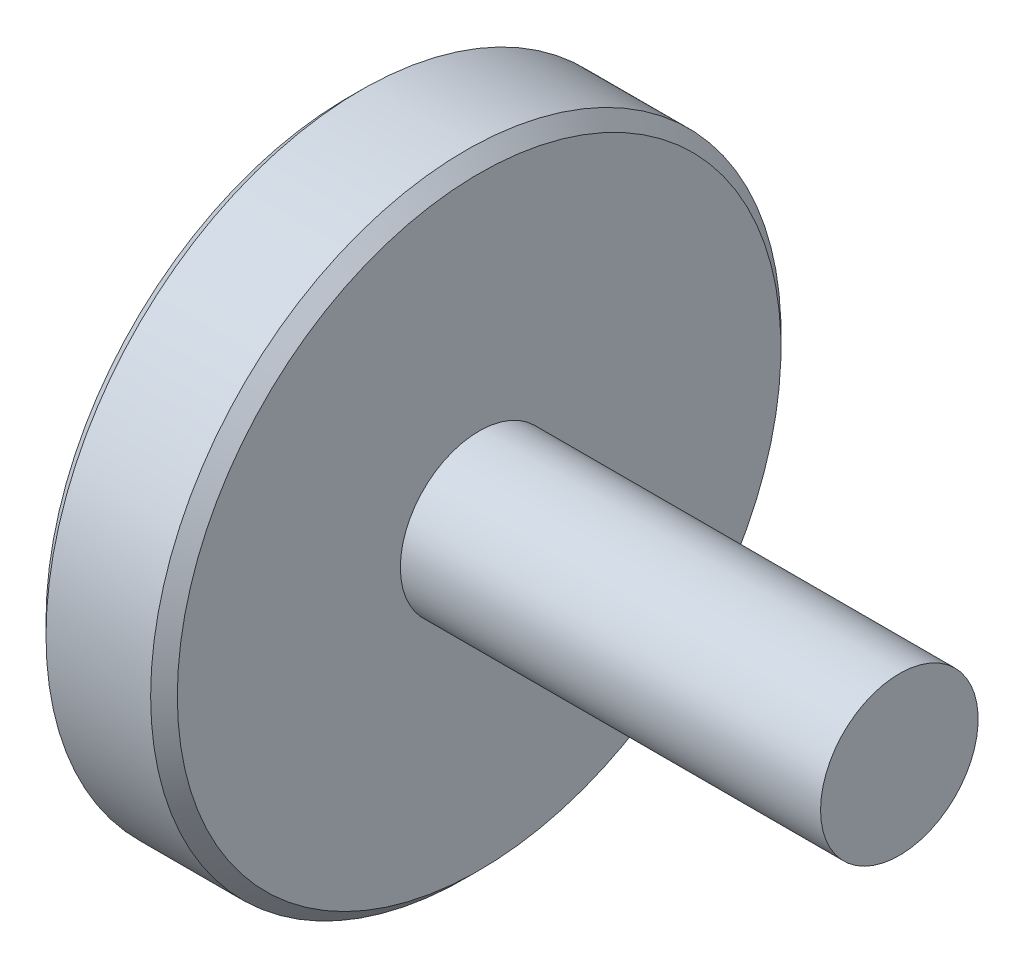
from build123d import *


with BuildPart() as part:
    # Sketch1 → Revolve1 (revolve)
    with BuildSketch(Plane(origin=(0, 0, 0), x_dir=(-1, 0, 0), z_dir=(0, 0, -1)), mode=Mode.PRIVATE) as revolve1_sk:
        Polygon((-10.5, 1.5), (-10.5, 0), (0, 0), (0, 5.746), (-0.254, 6), (-2.246, 6), (-2.5, 5.746), (-2.5, 1.5), align=None)
    revolve(revolve1_sk.sketch.rotate(Axis((10.5, 0, 0), (-1, 0, 0)), 270), axis=Axis((10.5, 0, 0), (-1, 0, 0)))


solid = part.part
